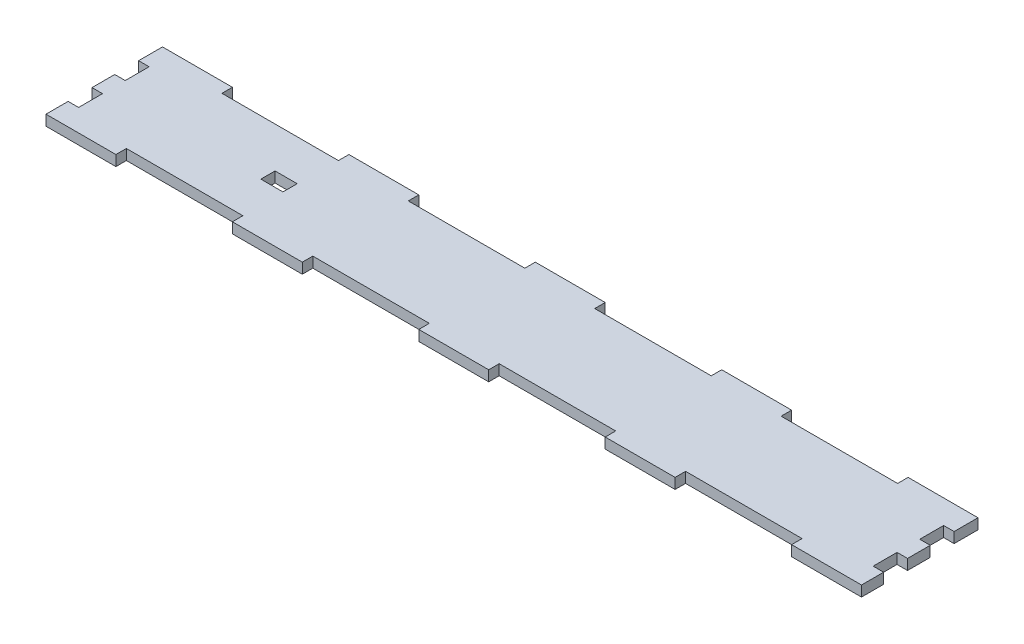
from build123d import *

# Parameters (mm, degrees)
BOSS_EXTRUDE1_DEPTH = 9
SKETCH2_W           = 100
SKETCH2_H           = 9
CUT_EXTRUDE1_DEPTH  = 9
SKETCH3_W           = 19
SKETCH3_H           = 12.2
CUT_EXTRUDE2_DEPTH  = 354.667923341


with BuildPart() as part:
    # Sketch1 → Boss-Extrude1 (new body)
    with BuildSketch(Plane(origin=(0, 0, 0), x_dir=(1, 0, 0), z_dir=(0, 1, 0))):
        Polygon((-350, 50), (350, 50), (350, 29.5), (341, 29.5), (341, 9), (350, 9), (350, -10.5), (341, -10.5), (341, -31), (350, -31), (350, -50), (-350, -50), (-350, -31), (-341, -31), (-341, -10.5), (-350, -10.5), (-350, 9), (-341, 9), (-341, 29.5), (-350, 29.5), align=None)
    extrude(amount=BOSS_EXTRUDE1_DEPTH)

    # Sketch2 → Cut-Extrude1 (cut)
    with BuildSketch(Plane(origin=(0, 9, 0), x_dir=(1, 0, 0), z_dir=(0, 1, 0))):
        with Locations((-240, 45.5)):
            Rectangle(SKETCH2_W, SKETCH2_H)
        with Locations((-80, 45.5)):
            Rectangle(SKETCH2_W, SKETCH2_H)
        with Locations((80, 45.5)):
            Rectangle(SKETCH2_W, SKETCH2_H)
        with Locations((240, 45.5)):
            Rectangle(SKETCH2_W, SKETCH2_H)
        with Locations((240, -45.5)):
            Rectangle(SKETCH2_W, SKETCH2_H)
        with Locations((80, -45.5)):
            Rectangle(SKETCH2_W, SKETCH2_H)
        with Locations((-80, -45.5)):
            Rectangle(SKETCH2_W, SKETCH2_H)
        with Locations((-240, -45.5)):
            Rectangle(SKETCH2_W, SKETCH2_H)
    extrude(amount=-CUT_EXTRUDE1_DEPTH, mode=Mode.SUBTRACT)

    # Sketch3 → Cut-Extrude2 (cut, through all)
    with BuildSketch(Plane(origin=(0, 9, 0), x_dir=(1, 0, 0), z_dir=(0, 1, 0))):
        with Locations((-200, 0)):
            Rectangle(SKETCH3_W, SKETCH3_H)
    extrude(amount=-CUT_EXTRUDE2_DEPTH, mode=Mode.SUBTRACT)


solid = part.part
